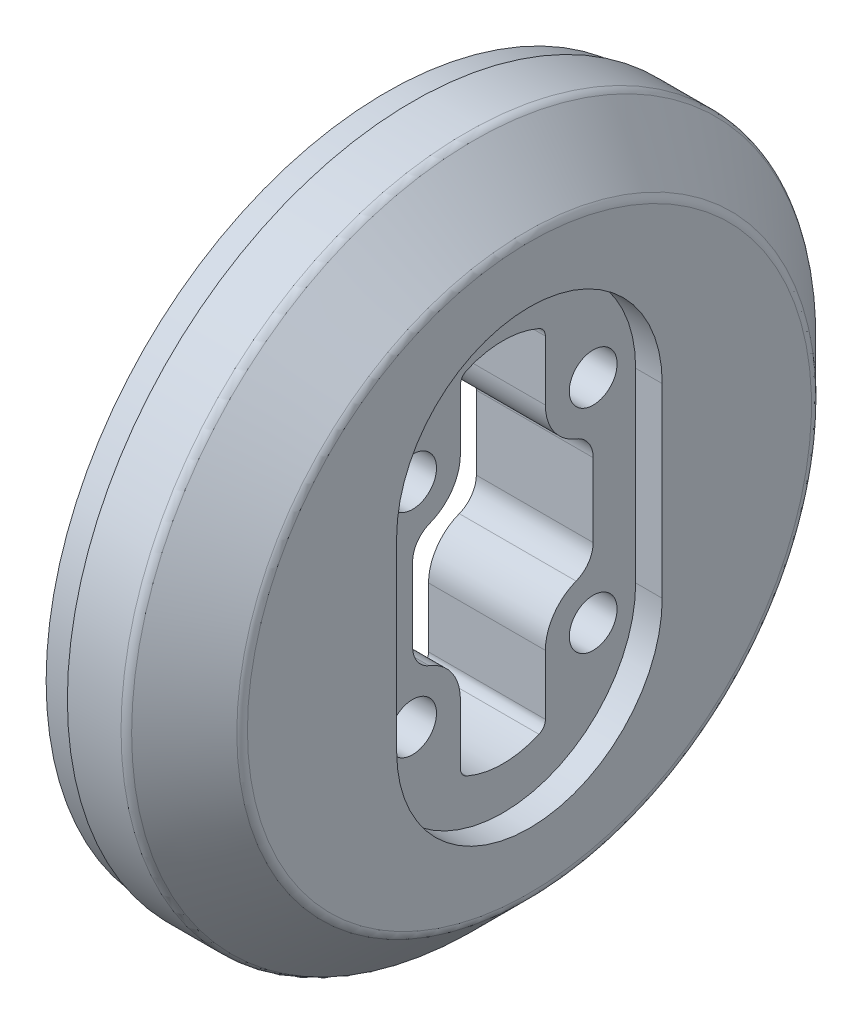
ISO-10303-21;
HEADER;
FILE_DESCRIPTION(('STEP AP214'),'2;1');
FILE_NAME('part.step','',(''),(''),'','','');
FILE_SCHEMA(('AUTOMOTIVE_DESIGN { 1 0 10303 214 1 1 1 1 }'));
ENDSEC;
DATA;
#1=APPLICATION_CONTEXT('core data for automotive mechanical design processes');
#2=APPLICATION_PROTOCOL_DEFINITION('international standard','automotive_design',2000,#1);
#3=PRODUCT_CONTEXT('',#1,'mechanical');
#4=PRODUCT('Part','Part','',(#3));
#5=PRODUCT_RELATED_PRODUCT_CATEGORY('part','',(#4));
#6=PRODUCT_DEFINITION_FORMATION('','',#4);
#7=PRODUCT_DEFINITION_CONTEXT('part definition',#1,'design');
#8=PRODUCT_DEFINITION('design','',#6,#7);
#9=PRODUCT_DEFINITION_SHAPE('','',#8);
#10=(LENGTH_UNIT() NAMED_UNIT(*) SI_UNIT(.MILLI.,.METRE.));
#11=(NAMED_UNIT(*) PLANE_ANGLE_UNIT() SI_UNIT($,.RADIAN.));
#12=(NAMED_UNIT(*) SI_UNIT($,.STERADIAN.) SOLID_ANGLE_UNIT());
#13=UNCERTAINTY_MEASURE_WITH_UNIT(LENGTH_MEASURE(1.E-05),#10,'distance_accuracy_value','');
#14=(GEOMETRIC_REPRESENTATION_CONTEXT(3) GLOBAL_UNCERTAINTY_ASSIGNED_CONTEXT((#13)) GLOBAL_UNIT_ASSIGNED_CONTEXT((#10,
#11,#12)) REPRESENTATION_CONTEXT('',''));
#15=CARTESIAN_POINT('',(0.,0.,0.));
#16=DIRECTION('',(0.,0.,1.));
#17=DIRECTION('',(1.,0.,0.));
#18=AXIS2_PLACEMENT_3D('',#15,#16,#17);
#19=CARTESIAN_POINT('',(0.,0.,0.));
#20=DIRECTION('',(1.,0.,0.));
#21=DIRECTION('',(0.,0.,-1.));
#22=AXIS2_PLACEMENT_3D('',#19,#20,#21);
#23=PLANE('',#22);
#24=CARTESIAN_POINT('',(0.,-17.5001431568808,-2.33473213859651E-13));
#25=DIRECTION('',(1.,0.,0.));
#26=DIRECTION('',(0.,0.,-1.));
#27=AXIS2_PLACEMENT_3D('',#24,#25,#26);
#28=CIRCLE('',#27,16.9999999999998);
#29=CARTESIAN_POINT('',(0.,-33.0809005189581,6.80000000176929));
#30=VERTEX_POINT('',#29);
#31=CARTESIAN_POINT('',(0.,-33.0809005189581,-6.80000000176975));
#32=VERTEX_POINT('',#31);
#33=EDGE_CURVE('E201',#30,#32,#28,.T.);
#34=ORIENTED_EDGE('',*,*,#33,.T.);
#35=CARTESIAN_POINT('',(0.,-31.2478702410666,-6.00000000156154));
#36=DIRECTION('',(1.,0.,0.));
#37=DIRECTION('',(0.,0.,-1.));
#38=AXIS2_PLACEMENT_3D('',#35,#36,#37);
#39=CIRCLE('',#38,2.00000000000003);
#40=CARTESIAN_POINT('',(0.,-31.2478702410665,-8.00000000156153));
#41=VERTEX_POINT('',#40);
#42=EDGE_CURVE('E195',#32,#41,#39,.T.);
#43=ORIENTED_EDGE('',*,*,#42,.T.);
#44=DIRECTION('',(0.,1.,0.));
#45=VECTOR('',#44,1.);
#46=CARTESIAN_POINT('',(0.,-31.2478702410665,-8.00000000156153));
#47=LINE('',#46,#45);
#48=CARTESIAN_POINT('',(0.,-20.0000000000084,-8.00000000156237));
#49=VERTEX_POINT('',#48);
#50=EDGE_CURVE('E204',#41,#49,#47,.T.);
#51=ORIENTED_EDGE('',*,*,#50,.T.);
#52=CARTESIAN_POINT('',(0.,-19.9999955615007,-17.0000000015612));
#53=DIRECTION('',(-1.,0.,0.));
#54=DIRECTION('',(0.,0.,-1.));
#55=AXIS2_PLACEMENT_3D('',#52,#53,#54);
#56=CIRCLE('',#55,8.99999999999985);
#57=CARTESIAN_POINT('',(0.,-11.5935475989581,-13.7857142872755));
#58=VERTEX_POINT('',#57);
#59=EDGE_CURVE('E47',#49,#58,#56,.T.);
#60=ORIENTED_EDGE('',*,*,#59,.T.);
#61=CARTESIAN_POINT('',(0.,-6.92329873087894,-12.0000000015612));
#62=DIRECTION('',(1.,0.,0.));
#63=DIRECTION('',(0.,0.,-1.));
#64=AXIS2_PLACEMENT_3D('',#61,#62,#63);
#65=CIRCLE('',#64,5.);
#66=CARTESIAN_POINT('',(0.,-6.92329873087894,-17.0000000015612));
#67=VERTEX_POINT('',#66);
#68=EDGE_CURVE('E218',#58,#67,#65,.T.);
#69=ORIENTED_EDGE('',*,*,#68,.T.);
#70=DIRECTION('',(0.,1.,0.));
#71=VECTOR('',#70,1.);
#72=CARTESIAN_POINT('',(0.,-6.92329873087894,-17.0000000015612));
#73=LINE('',#72,#71);
#74=CARTESIAN_POINT('',(0.,6.92329873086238,-17.0000000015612));
#75=VERTEX_POINT('',#74);
#76=EDGE_CURVE('E221',#67,#75,#73,.T.);
#77=ORIENTED_EDGE('',*,*,#76,.T.);
#78=CARTESIAN_POINT('',(0.,6.92329873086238,-12.0000000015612));
#79=DIRECTION('',(1.,0.,0.));
#80=DIRECTION('',(0.,0.,-1.));
#81=AXIS2_PLACEMENT_3D('',#78,#79,#80);
#82=CIRCLE('',#81,5.);
#83=CARTESIAN_POINT('',(0.,11.5935475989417,-13.7857142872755));
#84=VERTEX_POINT('',#83);
#85=EDGE_CURVE('E224',#75,#84,#82,.T.);
#86=ORIENTED_EDGE('',*,*,#85,.T.);
#87=CARTESIAN_POINT('',(0.,19.9999955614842,-17.0000000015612));
#88=DIRECTION('',(-1.,0.,0.));
#89=DIRECTION('',(0.,0.,-1.));
#90=AXIS2_PLACEMENT_3D('',#87,#88,#89);
#91=CIRCLE('',#90,8.99999999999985);
#92=CARTESIAN_POINT('',(0.,19.9999999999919,-8.00000000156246));
#93=VERTEX_POINT('',#92);
#94=EDGE_CURVE('E227',#84,#93,#91,.T.);
#95=ORIENTED_EDGE('',*,*,#94,.T.);
#96=DIRECTION('',(0.,1.,1.1736961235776E-13));
#97=VECTOR('',#96,1.);
#98=CARTESIAN_POINT('',(0.,19.9999999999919,-8.00000000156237));
#99=LINE('',#98,#97);
#100=CARTESIAN_POINT('',(0.,31.2475839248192,-8.00000000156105));
#101=VERTEX_POINT('',#100);
#102=EDGE_CURVE('E230',#93,#101,#99,.T.);
#103=ORIENTED_EDGE('',*,*,#102,.T.);
#104=CARTESIAN_POINT('',(0.,31.2475839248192,-6.0000000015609));
#105=DIRECTION('',(1.,0.,0.));
#106=DIRECTION('',(0.,0.,-1.));
#107=AXIS2_PLACEMENT_3D('',#104,#105,#106);
#108=CIRCLE('',#107,2.00000000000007);
#109=CARTESIAN_POINT('',(0.,33.0806142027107,-6.8000000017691));
#110=VERTEX_POINT('',#109);
#111=EDGE_CURVE('E233',#101,#110,#108,.T.);
#112=ORIENTED_EDGE('',*,*,#111,.T.);
#113=CARTESIAN_POINT('',(0.,17.4998568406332,-1.47702501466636E-13));
#114=DIRECTION('',(1.,0.,0.));
#115=DIRECTION('',(0.,0.,-1.));
#116=AXIS2_PLACEMENT_3D('',#113,#114,#115);
#117=CIRCLE('',#116,16.9999999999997);
#118=CARTESIAN_POINT('',(0.,33.0806142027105,6.80000000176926));
#119=VERTEX_POINT('',#118);
#120=EDGE_CURVE('E236',#110,#119,#117,.T.);
#121=ORIENTED_EDGE('',*,*,#120,.T.);
#122=CARTESIAN_POINT('',(0.,31.2475839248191,6.0000000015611));
#123=DIRECTION('',(1.,0.,0.));
#124=DIRECTION('',(0.,0.,-1.));
#125=AXIS2_PLACEMENT_3D('',#122,#123,#124);
#126=CIRCLE('',#125,2.00000000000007);
#127=CARTESIAN_POINT('',(0.,31.2475839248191,8.00000000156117));
#128=VERTEX_POINT('',#127);
#129=EDGE_CURVE('E239',#119,#128,#126,.T.);
#130=ORIENTED_EDGE('',*,*,#129,.T.);
#131=DIRECTION('',(0.,-1.,1.17986535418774E-13));
#132=VECTOR('',#131,1.);
#133=CARTESIAN_POINT('',(0.,31.2475839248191,8.00000000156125));
#134=LINE('',#133,#132);
#135=CARTESIAN_POINT('',(0.,19.9999999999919,8.00000000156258));
#136=VERTEX_POINT('',#135);
#137=EDGE_CURVE('E242',#128,#136,#134,.T.);
#138=ORIENTED_EDGE('',*,*,#137,.T.);
#139=CARTESIAN_POINT('',(0.,19.9999999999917,17.0000000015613));
#140=DIRECTION('',(-1.,0.,0.));
#141=DIRECTION('',(0.,0.,-1.));
#142=AXIS2_PLACEMENT_3D('',#139,#140,#141);
#143=CIRCLE('',#142,8.99999999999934);
#144=CARTESIAN_POINT('',(0.,11.5581126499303,13.8799778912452));
#145=VERTEX_POINT('',#144);
#146=EDGE_CURVE('E245',#136,#145,#143,.T.);
#147=ORIENTED_EDGE('',*,*,#146,.T.);
#148=CARTESIAN_POINT('',(0.,6.92499999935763,12.0000132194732));
#149=DIRECTION('',(1.,0.,0.));
#150=DIRECTION('',(0.,0.,-1.));
#151=AXIS2_PLACEMENT_3D('',#148,#149,#150);
#152=CIRCLE('',#151,4.99999999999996);
#153=CARTESIAN_POINT('',(0.,6.936496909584,17.0000000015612));
#154=VERTEX_POINT('',#153);
#155=EDGE_CURVE('E248',#145,#154,#152,.T.);
#156=ORIENTED_EDGE('',*,*,#155,.T.);
#157=DIRECTION('',(0.,-1.,0.));
#158=VECTOR('',#157,1.);
#159=CARTESIAN_POINT('',(0.,6.936496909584,17.0000000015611));
#160=LINE('',#159,#158);
#161=CARTESIAN_POINT('',(0.,-6.93649690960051,17.0000000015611));
#162=VERTEX_POINT('',#161);
#163=EDGE_CURVE('E251',#154,#162,#160,.T.);
#164=ORIENTED_EDGE('',*,*,#163,.T.);
#165=CARTESIAN_POINT('',(0.,-6.92499999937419,12.0000132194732));
#166=DIRECTION('',(1.,0.,0.));
#167=DIRECTION('',(0.,0.,-1.));
#168=AXIS2_PLACEMENT_3D('',#165,#166,#167);
#169=CIRCLE('',#168,4.99999999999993);
#170=CARTESIAN_POINT('',(0.,-11.5581126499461,13.8799778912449));
#171=VERTEX_POINT('',#170);
#172=EDGE_CURVE('E254',#162,#171,#169,.T.);
#173=ORIENTED_EDGE('',*,*,#172,.T.);
#174=CARTESIAN_POINT('',(0.,-20.0000000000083,17.0000000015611));
#175=DIRECTION('',(-1.,0.,0.));
#176=DIRECTION('',(0.,0.,-1.));
#177=AXIS2_PLACEMENT_3D('',#174,#175,#176);
#178=CIRCLE('',#177,9.00000000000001);
#179=CARTESIAN_POINT('',(0.,-20.0000000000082,8.00000000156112));
#180=VERTEX_POINT('',#179);
#181=EDGE_CURVE('E257',#171,#180,#178,.T.);
#182=ORIENTED_EDGE('',*,*,#181,.T.);
#183=DIRECTION('',(0.,-1.,0.));
#184=VECTOR('',#183,1.);
#185=CARTESIAN_POINT('',(0.,-20.0000000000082,8.0000000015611));
#186=LINE('',#185,#184);
#187=CARTESIAN_POINT('',(0.,-31.2478702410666,8.0000000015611));
#188=VERTEX_POINT('',#187);
#189=EDGE_CURVE('E260',#180,#188,#186,.T.);
#190=ORIENTED_EDGE('',*,*,#189,.T.);
#191=CARTESIAN_POINT('',(0.,-31.2478702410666,6.0000000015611));
#192=DIRECTION('',(1.,0.,0.));
#193=DIRECTION('',(0.,0.,-1.));
#194=AXIS2_PLACEMENT_3D('',#191,#192,#193);
#195=CIRCLE('',#194,2.);
#196=EDGE_CURVE('E263',#188,#30,#195,.T.);
#197=ORIENTED_EDGE('',*,*,#196,.T.);
#198=EDGE_LOOP('',(#34,#43,#51,#60,#69,#77,#86,#95,#103,#112,#121,#130,#138,#147,#156,#164,#173,
#182,#190,#197));
#199=FACE_BOUND('',#198,.T.);
#200=CARTESIAN_POINT('',(0.,-20.,-17.0000000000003));
#201=DIRECTION('',(1.,0.,0.));
#202=DIRECTION('',(0.,0.,-1.));
#203=AXIS2_PLACEMENT_3D('',#200,#201,#202);
#204=CIRCLE('',#203,4.49999999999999);
#205=CARTESIAN_POINT('',(0.,-20.,-21.5000000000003));
#206=VERTEX_POINT('',#205);
#207=EDGE_CURVE('E321',#206,#206,#204,.T.);
#208=ORIENTED_EDGE('',*,*,#207,.T.);
#209=EDGE_LOOP('',(#208));
#210=FACE_BOUND('',#209,.T.);
#211=CARTESIAN_POINT('',(0.,-20.0000000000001,16.9999999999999));
#212=DIRECTION('',(1.,0.,0.));
#213=DIRECTION('',(0.,0.,-1.));
#214=AXIS2_PLACEMENT_3D('',#211,#212,#213);
#215=CIRCLE('',#214,4.49999999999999);
#216=CARTESIAN_POINT('',(0.,-20.0000000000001,12.4999999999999));
#217=VERTEX_POINT('',#216);
#218=EDGE_CURVE('E362',#217,#217,#215,.T.);
#219=ORIENTED_EDGE('',*,*,#218,.T.);
#220=EDGE_LOOP('',(#219));
#221=FACE_BOUND('',#220,.T.);
#222=CARTESIAN_POINT('',(0.,19.9999999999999,17.));
#223=DIRECTION('',(1.,0.,0.));
#224=DIRECTION('',(0.,0.,-1.));
#225=AXIS2_PLACEMENT_3D('',#222,#223,#224);
#226=CIRCLE('',#225,4.5);
#227=CARTESIAN_POINT('',(0.,19.9999999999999,12.5000000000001));
#228=VERTEX_POINT('',#227);
#229=EDGE_CURVE('E368',#228,#228,#226,.T.);
#230=ORIENTED_EDGE('',*,*,#229,.T.);
#231=EDGE_LOOP('',(#230));
#232=FACE_BOUND('',#231,.T.);
#233=CARTESIAN_POINT('',(0.,20.,-17.0000000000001));
#234=DIRECTION('',(1.,0.,0.));
#235=DIRECTION('',(0.,0.,-1.));
#236=AXIS2_PLACEMENT_3D('',#233,#234,#235);
#237=CIRCLE('',#236,4.49999999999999);
#238=CARTESIAN_POINT('',(0.,20.,-21.5000000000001));
#239=VERTEX_POINT('',#238);
#240=EDGE_CURVE('E374',#239,#239,#237,.T.);
#241=ORIENTED_EDGE('',*,*,#240,.T.);
#242=EDGE_LOOP('',(#241));
#243=FACE_BOUND('',#242,.T.);
#244=CARTESIAN_POINT('',(0.,0.,0.));
#245=DIRECTION('',(-1.,0.,0.));
#246=DIRECTION('',(0.,0.,1.));
#247=AXIS2_PLACEMENT_3D('',#244,#245,#246);
#248=CIRCLE('',#247,64.);
#249=CARTESIAN_POINT('',(0.,0.,64.));
#250=VERTEX_POINT('',#249);
#251=EDGE_CURVE('E11',#250,#250,#248,.T.);
#252=ORIENTED_EDGE('',*,*,#251,.T.);
#253=EDGE_LOOP('',(#252));
#254=FACE_BOUND('',#253,.T.);
#255=ADVANCED_FACE('F33',(#199,#210,#221,#232,#243,#254),#23,.F.);
#256=CARTESIAN_POINT('',(-23.9525272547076,0.,0.));
#257=DIRECTION('',(-1.,0.,0.));
#258=DIRECTION('',(0.,0.,1.));
#259=AXIS2_PLACEMENT_3D('',#256,#257,#258);
#260=CYLINDRICAL_SURFACE('',#259,64.);
#261=ORIENTED_EDGE('',*,*,#251,.F.);
#262=EDGE_LOOP('',(#261));
#263=FACE_BOUND('',#262,.T.);
#264=CARTESIAN_POINT('',(5.,0.,0.));
#265=DIRECTION('',(-1.,0.,0.));
#266=DIRECTION('',(0.,0.,1.));
#267=AXIS2_PLACEMENT_3D('',#264,#265,#266);
#268=CIRCLE('',#267,64.);
#269=CARTESIAN_POINT('',(5.,0.,64.));
#270=VERTEX_POINT('',#269);
#271=EDGE_CURVE('E40',#270,#270,#268,.T.);
#272=ORIENTED_EDGE('',*,*,#271,.T.);
#273=EDGE_LOOP('',(#272));
#274=FACE_BOUND('',#273,.T.);
#275=ADVANCED_FACE('F429',(#263,#274),#260,.T.);
#276=CARTESIAN_POINT('',(5.,64.,0.));
#277=DIRECTION('',(1.,0.,0.));
#278=DIRECTION('',(0.,0.,-1.));
#279=AXIS2_PLACEMENT_3D('',#276,#277,#278);
#280=PLANE('',#279);
#281=ORIENTED_EDGE('',*,*,#271,.F.);
#282=EDGE_LOOP('',(#281));
#283=FACE_BOUND('',#282,.T.);
#284=CARTESIAN_POINT('',(5.,0.,0.));
#285=DIRECTION('',(-1.,0.,0.));
#286=DIRECTION('',(0.,0.,1.));
#287=AXIS2_PLACEMENT_3D('',#284,#285,#286);
#288=CIRCLE('',#287,65.);
#289=CARTESIAN_POINT('',(5.,0.,65.));
#290=VERTEX_POINT('',#289);
#291=EDGE_CURVE('E424',#290,#290,#288,.T.);
#292=ORIENTED_EDGE('',*,*,#291,.T.);
#293=EDGE_LOOP('',(#292));
#294=FACE_BOUND('',#293,.T.);
#295=ADVANCED_FACE('F431',(#283,#294),#280,.F.);
#296=CARTESIAN_POINT('',(-23.9525272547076,0.,0.));
#297=DIRECTION('',(-1.,0.,0.));
#298=DIRECTION('',(0.,0.,1.));
#299=AXIS2_PLACEMENT_3D('',#296,#297,#298);
#300=CYLINDRICAL_SURFACE('',#299,65.);
#301=ORIENTED_EDGE('',*,*,#291,.F.);
#302=EDGE_LOOP('',(#301));
#303=FACE_BOUND('',#302,.T.);
#304=CARTESIAN_POINT('',(15.1,0.,0.));
#305=DIRECTION('',(-1.,0.,0.));
#306=DIRECTION('',(0.,0.,1.));
#307=AXIS2_PLACEMENT_3D('',#304,#305,#306);
#308=CIRCLE('',#307,65.);
#309=CARTESIAN_POINT('',(15.1,0.,65.));
#310=VERTEX_POINT('',#309);
#311=EDGE_CURVE('E421',#310,#310,#308,.T.);
#312=ORIENTED_EDGE('',*,*,#311,.T.);
#313=EDGE_LOOP('',(#312));
#314=FACE_BOUND('',#313,.T.);
#315=ADVANCED_FACE('F434',(#303,#314),#300,.T.);
#316=CARTESIAN_POINT('',(15.1,0.,0.));
#317=DIRECTION('',(-1.,0.,0.));
#318=DIRECTION('',(0.,0.,1.));
#319=AXIS2_PLACEMENT_3D('',#316,#317,#318);
#320=TOROIDAL_SURFACE('',#319,63.,2.);
#321=ORIENTED_EDGE('',*,*,#311,.F.);
#322=EDGE_LOOP('',(#321));
#323=FACE_BOUND('',#322,.T.);
#324=CARTESIAN_POINT('',(16.5142135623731,0.,0.));
#325=DIRECTION('',(-1.,0.,0.));
#326=DIRECTION('',(0.,0.,1.));
#327=AXIS2_PLACEMENT_3D('',#324,#325,#326);
#328=CIRCLE('',#327,64.4142135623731);
#329=CARTESIAN_POINT('',(16.5142135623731,0.,64.4142135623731));
#330=VERTEX_POINT('',#329);
#331=EDGE_CURVE('E418',#330,#330,#328,.T.);
#332=ORIENTED_EDGE('',*,*,#331,.T.);
#333=EDGE_LOOP('',(#332));
#334=FACE_BOUND('',#333,.T.);
#335=ADVANCED_FACE('F440',(#323,#334),#320,.T.);
#336=CARTESIAN_POINT('',(26.4142135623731,0.,0.));
#337=DIRECTION('',(-1.,0.,0.));
#338=DIRECTION('',(0.,0.,1.));
#339=AXIS2_PLACEMENT_3D('',#336,#337,#338);
#340=CONICAL_SURFACE('',#339,54.5142135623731,0.78539816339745);
#341=ORIENTED_EDGE('',*,*,#331,.F.);
#342=EDGE_LOOP('',(#341));
#343=FACE_BOUND('',#342,.T.);
#344=CARTESIAN_POINT('',(26.4142135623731,0.,0.));
#345=DIRECTION('',(-1.,0.,0.));
#346=DIRECTION('',(0.,0.,1.));
#347=AXIS2_PLACEMENT_3D('',#344,#345,#346);
#348=CIRCLE('',#347,54.5142135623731);
#349=CARTESIAN_POINT('',(26.4142135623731,0.,54.5142135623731));
#350=VERTEX_POINT('',#349);
#351=EDGE_CURVE('E415',#350,#350,#348,.T.);
#352=ORIENTED_EDGE('',*,*,#351,.T.);
#353=EDGE_LOOP('',(#352));
#354=FACE_BOUND('',#353,.T.);
#355=ADVANCED_FACE('F446',(#343,#354),#340,.T.);
#356=CARTESIAN_POINT('',(25.,0.,0.));
#357=DIRECTION('',(-1.,0.,0.));
#358=DIRECTION('',(0.,0.,1.));
#359=AXIS2_PLACEMENT_3D('',#356,#357,#358);
#360=TOROIDAL_SURFACE('',#359,53.1,2.);
#361=ORIENTED_EDGE('',*,*,#351,.F.);
#362=EDGE_LOOP('',(#361));
#363=FACE_BOUND('',#362,.T.);
#364=CARTESIAN_POINT('',(27.,0.,0.));
#365=DIRECTION('',(-1.,0.,0.));
#366=DIRECTION('',(0.,0.,1.));
#367=AXIS2_PLACEMENT_3D('',#364,#365,#366);
#368=CIRCLE('',#367,53.1);
#369=CARTESIAN_POINT('',(27.,0.,53.1));
#370=VERTEX_POINT('',#369);
#371=EDGE_CURVE('E406',#370,#370,#368,.T.);
#372=ORIENTED_EDGE('',*,*,#371,.T.);
#373=EDGE_LOOP('',(#372));
#374=FACE_BOUND('',#373,.T.);
#375=ADVANCED_FACE('F452',(#363,#374),#360,.T.);
#376=CARTESIAN_POINT('',(27.,53.1,0.));
#377=DIRECTION('',(-1.,0.,0.));
#378=DIRECTION('',(0.,0.,1.));
#379=AXIS2_PLACEMENT_3D('',#376,#377,#378);
#380=PLANE('',#379);
#381=DIRECTION('',(0.,1.,0.));
#382=VECTOR('',#381,1.);
#383=CARTESIAN_POINT('',(27.,-17.5,-24.9999999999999));
#384=LINE('',#383,#382);
#385=CARTESIAN_POINT('',(27.,-17.5,-24.9999999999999));
#386=VERTEX_POINT('',#385);
#387=CARTESIAN_POINT('',(27.,17.5000000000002,-24.9999999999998));
#388=VERTEX_POINT('',#387);
#389=EDGE_CURVE('E396',#386,#388,#384,.T.);
#390=ORIENTED_EDGE('',*,*,#389,.F.);
#391=CARTESIAN_POINT('',(27.,-17.5000000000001,0.));
#392=DIRECTION('',(1.,0.,0.));
#393=DIRECTION('',(0.,0.,-1.));
#394=AXIS2_PLACEMENT_3D('',#391,#392,#393);
#395=CIRCLE('',#394,25.);
#396=CARTESIAN_POINT('',(27.,-17.5000000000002,25.0000000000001));
#397=VERTEX_POINT('',#396);
#398=EDGE_CURVE('E380',#397,#386,#395,.T.);
#399=ORIENTED_EDGE('',*,*,#398,.F.);
#400=DIRECTION('',(0.,-1.,0.));
#401=VECTOR('',#400,1.);
#402=CARTESIAN_POINT('',(27.,17.5,25.0000000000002));
#403=LINE('',#402,#401);
#404=CARTESIAN_POINT('',(27.,17.5,25.0000000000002));
#405=VERTEX_POINT('',#404);
#406=EDGE_CURVE('E385',#405,#397,#403,.T.);
#407=ORIENTED_EDGE('',*,*,#406,.F.);
#408=CARTESIAN_POINT('',(27.,17.5000000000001,2.22044604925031E-13));
#409=DIRECTION('',(1.,0.,0.));
#410=DIRECTION('',(0.,0.,-1.));
#411=AXIS2_PLACEMENT_3D('',#408,#409,#410);
#412=CIRCLE('',#411,25.);
#413=EDGE_CURVE('E399',#388,#405,#412,.T.);
#414=ORIENTED_EDGE('',*,*,#413,.F.);
#415=EDGE_LOOP('',(#390,#399,#407,#414));
#416=FACE_BOUND('',#415,.T.);
#417=ORIENTED_EDGE('',*,*,#371,.F.);
#418=EDGE_LOOP('',(#417));
#419=FACE_BOUND('',#418,.T.);
#420=ADVANCED_FACE('F458',(#416,#419),#380,.F.);
#421=CARTESIAN_POINT('',(22.,-17.5000000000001,0.));
#422=DIRECTION('',(1.,0.,0.));
#423=DIRECTION('',(0.,0.,-1.));
#424=AXIS2_PLACEMENT_3D('',#421,#422,#423);
#425=CYLINDRICAL_SURFACE('',#424,25.);
#426=ORIENTED_EDGE('',*,*,#398,.T.);
#427=DIRECTION('',(1.,0.,0.));
#428=VECTOR('',#427,1.);
#429=CARTESIAN_POINT('',(22.,-17.5,-24.9999999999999));
#430=LINE('',#429,#428);
#431=CARTESIAN_POINT('',(22.,-17.5,-24.9999999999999));
#432=VERTEX_POINT('',#431);
#433=EDGE_CURVE('E394',#432,#386,#430,.T.);
#434=ORIENTED_EDGE('',*,*,#433,.F.);
#435=CARTESIAN_POINT('',(22.,-17.5000000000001,0.));
#436=DIRECTION('',(1.,0.,0.));
#437=DIRECTION('',(0.,0.,-1.));
#438=AXIS2_PLACEMENT_3D('',#435,#436,#437);
#439=CIRCLE('',#438,25.);
#440=CARTESIAN_POINT('',(22.,-17.5000000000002,25.0000000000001));
#441=VERTEX_POINT('',#440);
#442=EDGE_CURVE('E381',#441,#432,#439,.T.);
#443=ORIENTED_EDGE('',*,*,#442,.F.);
#444=DIRECTION('',(1.,0.,0.));
#445=VECTOR('',#444,1.);
#446=CARTESIAN_POINT('',(22.,-17.5000000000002,25.0000000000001));
#447=LINE('',#446,#445);
#448=EDGE_CURVE('E404',#441,#397,#447,.T.);
#449=ORIENTED_EDGE('',*,*,#448,.T.);
#450=EDGE_LOOP('',(#426,#434,#443,#449));
#451=FACE_BOUND('',#450,.T.);
#452=ADVANCED_FACE('F463',(#451),#425,.F.);
#453=CARTESIAN_POINT('',(22.,17.5,25.0000000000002));
#454=DIRECTION('',(0.,0.,1.));
#455=DIRECTION('',(0.,-1.,0.));
#456=AXIS2_PLACEMENT_3D('',#453,#454,#455);
#457=PLANE('',#456);
#458=ORIENTED_EDGE('',*,*,#406,.T.);
#459=ORIENTED_EDGE('',*,*,#448,.F.);
#460=DIRECTION('',(0.,-1.,0.));
#461=VECTOR('',#460,1.);
#462=CARTESIAN_POINT('',(22.,17.5,25.0000000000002));
#463=LINE('',#462,#461);
#464=CARTESIAN_POINT('',(22.,17.5,25.0000000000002));
#465=VERTEX_POINT('',#464);
#466=EDGE_CURVE('E391',#465,#441,#463,.T.);
#467=ORIENTED_EDGE('',*,*,#466,.F.);
#468=DIRECTION('',(1.,0.,0.));
#469=VECTOR('',#468,1.);
#470=CARTESIAN_POINT('',(22.,17.5,25.0000000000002));
#471=LINE('',#470,#469);
#472=EDGE_CURVE('E407',#465,#405,#471,.T.);
#473=ORIENTED_EDGE('',*,*,#472,.T.);
#474=EDGE_LOOP('',(#458,#459,#467,#473));
#475=FACE_BOUND('',#474,.T.);
#476=ADVANCED_FACE('F469',(#475),#457,.F.);
#477=CARTESIAN_POINT('',(22.,17.5000000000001,2.22044604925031E-13));
#478=DIRECTION('',(1.,0.,0.));
#479=DIRECTION('',(0.,0.,-1.));
#480=AXIS2_PLACEMENT_3D('',#477,#478,#479);
#481=CYLINDRICAL_SURFACE('',#480,25.);
#482=ORIENTED_EDGE('',*,*,#413,.T.);
#483=ORIENTED_EDGE('',*,*,#472,.F.);
#484=CARTESIAN_POINT('',(22.,17.5000000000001,2.22044604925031E-13));
#485=DIRECTION('',(1.,0.,0.));
#486=DIRECTION('',(0.,0.,-1.));
#487=AXIS2_PLACEMENT_3D('',#484,#485,#486);
#488=CIRCLE('',#487,25.);
#489=CARTESIAN_POINT('',(22.,17.5000000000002,-24.9999999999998));
#490=VERTEX_POINT('',#489);
#491=EDGE_CURVE('E388',#490,#465,#488,.T.);
#492=ORIENTED_EDGE('',*,*,#491,.F.);
#493=DIRECTION('',(1.,0.,0.));
#494=VECTOR('',#493,1.);
#495=CARTESIAN_POINT('',(22.,17.5000000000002,-24.9999999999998));
#496=LINE('',#495,#494);
#497=EDGE_CURVE('E409',#490,#388,#496,.T.);
#498=ORIENTED_EDGE('',*,*,#497,.T.);
#499=EDGE_LOOP('',(#482,#483,#492,#498));
#500=FACE_BOUND('',#499,.T.);
#501=ADVANCED_FACE('F521',(#500),#481,.F.);
#502=CARTESIAN_POINT('',(22.,-17.5,-24.9999999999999));
#503=DIRECTION('',(0.,0.,-1.));
#504=DIRECTION('',(0.,1.,0.));
#505=AXIS2_PLACEMENT_3D('',#502,#503,#504);
#506=PLANE('',#505);
#507=ORIENTED_EDGE('',*,*,#389,.T.);
#508=ORIENTED_EDGE('',*,*,#497,.F.);
#509=DIRECTION('',(0.,1.,0.));
#510=VECTOR('',#509,1.);
#511=CARTESIAN_POINT('',(22.,-17.5,-24.9999999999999));
#512=LINE('',#511,#510);
#513=EDGE_CURVE('E384',#432,#490,#512,.T.);
#514=ORIENTED_EDGE('',*,*,#513,.F.);
#515=ORIENTED_EDGE('',*,*,#433,.T.);
#516=EDGE_LOOP('',(#507,#508,#514,#515));
#517=FACE_BOUND('',#516,.T.);
#518=ADVANCED_FACE('F531',(#517),#506,.F.);
#519=CARTESIAN_POINT('',(22.,-17.5000000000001,0.));
#520=DIRECTION('',(1.,0.,0.));
#521=DIRECTION('',(0.,0.,-1.));
#522=AXIS2_PLACEMENT_3D('',#519,#520,#521);
#523=PLANE('',#522);
#524=CARTESIAN_POINT('',(22.,-31.2478702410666,-6.00000000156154));
#525=DIRECTION('',(1.,0.,0.));
#526=DIRECTION('',(0.,0.,-1.));
#527=AXIS2_PLACEMENT_3D('',#524,#525,#526);
#528=CIRCLE('',#527,2.00000000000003);
#529=CARTESIAN_POINT('',(22.,-33.0809005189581,-6.80000000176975));
#530=VERTEX_POINT('',#529);
#531=CARTESIAN_POINT('',(22.,-31.2478702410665,-8.00000000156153));
#532=VERTEX_POINT('',#531);
#533=EDGE_CURVE('E55',#530,#532,#528,.T.);
#534=ORIENTED_EDGE('',*,*,#533,.F.);
#535=CARTESIAN_POINT('',(22.,-17.5001431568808,-2.33473213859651E-13));
#536=DIRECTION('',(1.,0.,0.));
#537=DIRECTION('',(0.,0.,-1.));
#538=AXIS2_PLACEMENT_3D('',#535,#536,#537);
#539=CIRCLE('',#538,16.9999999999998);
#540=CARTESIAN_POINT('',(22.,-33.0809005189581,6.80000000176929));
#541=VERTEX_POINT('',#540);
#542=EDGE_CURVE('E211',#541,#530,#539,.T.);
#543=ORIENTED_EDGE('',*,*,#542,.F.);
#544=CARTESIAN_POINT('',(22.,-31.2478702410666,6.0000000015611));
#545=DIRECTION('',(1.,0.,0.));
#546=DIRECTION('',(0.,0.,-1.));
#547=AXIS2_PLACEMENT_3D('',#544,#545,#546);
#548=CIRCLE('',#547,2.);
#549=CARTESIAN_POINT('',(22.,-31.2478702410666,8.0000000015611));
#550=VERTEX_POINT('',#549);
#551=EDGE_CURVE('E214',#550,#541,#548,.T.);
#552=ORIENTED_EDGE('',*,*,#551,.F.);
#553=DIRECTION('',(0.,-1.,0.));
#554=VECTOR('',#553,1.);
#555=CARTESIAN_POINT('',(22.,-20.0000000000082,8.0000000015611));
#556=LINE('',#555,#554);
#557=CARTESIAN_POINT('',(22.,-20.0000000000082,8.00000000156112));
#558=VERTEX_POINT('',#557);
#559=EDGE_CURVE('E314',#558,#550,#556,.T.);
#560=ORIENTED_EDGE('',*,*,#559,.F.);
#561=CARTESIAN_POINT('',(22.,-20.0000000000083,17.0000000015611));
#562=DIRECTION('',(-1.,0.,0.));
#563=DIRECTION('',(0.,0.,-1.));
#564=AXIS2_PLACEMENT_3D('',#561,#562,#563);
#565=CIRCLE('',#564,9.00000000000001);
#566=CARTESIAN_POINT('',(22.,-11.5581126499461,13.8799778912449));
#567=VERTEX_POINT('',#566);
#568=EDGE_CURVE('E311',#567,#558,#565,.T.);
#569=ORIENTED_EDGE('',*,*,#568,.F.);
#570=CARTESIAN_POINT('',(22.,-6.92499999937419,12.0000132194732));
#571=DIRECTION('',(1.,0.,0.));
#572=DIRECTION('',(0.,0.,-1.));
#573=AXIS2_PLACEMENT_3D('',#570,#571,#572);
#574=CIRCLE('',#573,4.99999999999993);
#575=CARTESIAN_POINT('',(22.,-6.93649690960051,17.0000000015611));
#576=VERTEX_POINT('',#575);
#577=EDGE_CURVE('E308',#576,#567,#574,.T.);
#578=ORIENTED_EDGE('',*,*,#577,.F.);
#579=DIRECTION('',(0.,-1.,0.));
#580=VECTOR('',#579,1.);
#581=CARTESIAN_POINT('',(22.,6.936496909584,17.0000000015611));
#582=LINE('',#581,#580);
#583=CARTESIAN_POINT('',(22.,6.936496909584,17.0000000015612));
#584=VERTEX_POINT('',#583);
#585=EDGE_CURVE('E305',#584,#576,#582,.T.);
#586=ORIENTED_EDGE('',*,*,#585,.F.);
#587=CARTESIAN_POINT('',(22.,6.92499999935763,12.0000132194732));
#588=DIRECTION('',(1.,0.,0.));
#589=DIRECTION('',(0.,0.,-1.));
#590=AXIS2_PLACEMENT_3D('',#587,#588,#589);
#591=CIRCLE('',#590,4.99999999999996);
#592=CARTESIAN_POINT('',(22.,11.5581126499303,13.8799778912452));
#593=VERTEX_POINT('',#592);
#594=EDGE_CURVE('E302',#593,#584,#591,.T.);
#595=ORIENTED_EDGE('',*,*,#594,.F.);
#596=CARTESIAN_POINT('',(22.,19.9999999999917,17.0000000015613));
#597=DIRECTION('',(-1.,0.,0.));
#598=DIRECTION('',(0.,0.,-1.));
#599=AXIS2_PLACEMENT_3D('',#596,#597,#598);
#600=CIRCLE('',#599,8.99999999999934);
#601=CARTESIAN_POINT('',(22.,19.9999999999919,8.00000000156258));
#602=VERTEX_POINT('',#601);
#603=EDGE_CURVE('E299',#602,#593,#600,.T.);
#604=ORIENTED_EDGE('',*,*,#603,.F.);
#605=DIRECTION('',(0.,-1.,1.17986535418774E-13));
#606=VECTOR('',#605,1.);
#607=CARTESIAN_POINT('',(22.,31.2475839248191,8.00000000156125));
#608=LINE('',#607,#606);
#609=CARTESIAN_POINT('',(22.,31.2475839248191,8.00000000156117));
#610=VERTEX_POINT('',#609);
#611=EDGE_CURVE('E296',#610,#602,#608,.T.);
#612=ORIENTED_EDGE('',*,*,#611,.F.);
#613=CARTESIAN_POINT('',(22.,31.2475839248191,6.0000000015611));
#614=DIRECTION('',(1.,0.,0.));
#615=DIRECTION('',(0.,0.,-1.));
#616=AXIS2_PLACEMENT_3D('',#613,#614,#615);
#617=CIRCLE('',#616,2.00000000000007);
#618=CARTESIAN_POINT('',(22.,33.0806142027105,6.80000000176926));
#619=VERTEX_POINT('',#618);
#620=EDGE_CURVE('E293',#619,#610,#617,.T.);
#621=ORIENTED_EDGE('',*,*,#620,.F.);
#622=CARTESIAN_POINT('',(22.,17.4998568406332,-1.47702501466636E-13));
#623=DIRECTION('',(1.,0.,0.));
#624=DIRECTION('',(0.,0.,-1.));
#625=AXIS2_PLACEMENT_3D('',#622,#623,#624);
#626=CIRCLE('',#625,16.9999999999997);
#627=CARTESIAN_POINT('',(22.,33.0806142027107,-6.8000000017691));
#628=VERTEX_POINT('',#627);
#629=EDGE_CURVE('E290',#628,#619,#626,.T.);
#630=ORIENTED_EDGE('',*,*,#629,.F.);
#631=CARTESIAN_POINT('',(22.,31.2475839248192,-6.0000000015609));
#632=DIRECTION('',(1.,0.,0.));
#633=DIRECTION('',(0.,0.,-1.));
#634=AXIS2_PLACEMENT_3D('',#631,#632,#633);
#635=CIRCLE('',#634,2.00000000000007);
#636=CARTESIAN_POINT('',(22.,31.2475839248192,-8.00000000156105));
#637=VERTEX_POINT('',#636);
#638=EDGE_CURVE('E287',#637,#628,#635,.T.);
#639=ORIENTED_EDGE('',*,*,#638,.F.);
#640=DIRECTION('',(0.,1.,1.1736961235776E-13));
#641=VECTOR('',#640,1.);
#642=CARTESIAN_POINT('',(22.,19.9999999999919,-8.00000000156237));
#643=LINE('',#642,#641);
#644=CARTESIAN_POINT('',(22.,19.9999999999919,-8.00000000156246));
#645=VERTEX_POINT('',#644);
#646=EDGE_CURVE('E284',#645,#637,#643,.T.);
#647=ORIENTED_EDGE('',*,*,#646,.F.);
#648=CARTESIAN_POINT('',(22.,19.9999955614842,-17.0000000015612));
#649=DIRECTION('',(-1.,0.,0.));
#650=DIRECTION('',(0.,0.,-1.));
#651=AXIS2_PLACEMENT_3D('',#648,#649,#650);
#652=CIRCLE('',#651,8.99999999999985);
#653=CARTESIAN_POINT('',(22.,11.5935475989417,-13.7857142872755));
#654=VERTEX_POINT('',#653);
#655=EDGE_CURVE('E281',#654,#645,#652,.T.);
#656=ORIENTED_EDGE('',*,*,#655,.F.);
#657=CARTESIAN_POINT('',(22.,6.92329873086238,-12.0000000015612));
#658=DIRECTION('',(1.,0.,0.));
#659=DIRECTION('',(0.,0.,-1.));
#660=AXIS2_PLACEMENT_3D('',#657,#658,#659);
#661=CIRCLE('',#660,5.);
#662=CARTESIAN_POINT('',(22.,6.92329873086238,-17.0000000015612));
#663=VERTEX_POINT('',#662);
#664=EDGE_CURVE('E278',#663,#654,#661,.T.);
#665=ORIENTED_EDGE('',*,*,#664,.F.);
#666=DIRECTION('',(0.,1.,0.));
#667=VECTOR('',#666,1.);
#668=CARTESIAN_POINT('',(22.,-6.92329873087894,-17.0000000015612));
#669=LINE('',#668,#667);
#670=CARTESIAN_POINT('',(22.,-6.92329873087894,-17.0000000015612));
#671=VERTEX_POINT('',#670);
#672=EDGE_CURVE('E275',#671,#663,#669,.T.);
#673=ORIENTED_EDGE('',*,*,#672,.F.);
#674=CARTESIAN_POINT('',(22.,-6.92329873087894,-12.0000000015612));
#675=DIRECTION('',(1.,0.,0.));
#676=DIRECTION('',(0.,0.,-1.));
#677=AXIS2_PLACEMENT_3D('',#674,#675,#676);
#678=CIRCLE('',#677,5.);
#679=CARTESIAN_POINT('',(22.,-11.5935475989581,-13.7857142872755));
#680=VERTEX_POINT('',#679);
#681=EDGE_CURVE('E272',#680,#671,#678,.T.);
#682=ORIENTED_EDGE('',*,*,#681,.F.);
#683=CARTESIAN_POINT('',(22.,-19.9999955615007,-17.0000000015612));
#684=DIRECTION('',(-1.,0.,0.));
#685=DIRECTION('',(0.,0.,-1.));
#686=AXIS2_PLACEMENT_3D('',#683,#684,#685);
#687=CIRCLE('',#686,8.99999999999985);
#688=CARTESIAN_POINT('',(22.,-20.0000000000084,-8.00000000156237));
#689=VERTEX_POINT('',#688);
#690=EDGE_CURVE('E269',#689,#680,#687,.T.);
#691=ORIENTED_EDGE('',*,*,#690,.F.);
#692=DIRECTION('',(0.,1.,0.));
#693=VECTOR('',#692,1.);
#694=CARTESIAN_POINT('',(22.,-31.2478702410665,-8.00000000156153));
#695=LINE('',#694,#693);
#696=EDGE_CURVE('E267',#532,#689,#695,.T.);
#697=ORIENTED_EDGE('',*,*,#696,.F.);
#698=EDGE_LOOP('',(#534,#543,#552,#560,#569,#578,#586,#595,#604,#612,#621,#630,#639,#647,#656,
#665,#673,#682,#691,#697));
#699=FACE_BOUND('',#698,.T.);
#700=CARTESIAN_POINT('',(22.,-20.,-17.0000000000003));
#701=DIRECTION('',(1.,0.,0.));
#702=DIRECTION('',(0.,0.,-1.));
#703=AXIS2_PLACEMENT_3D('',#700,#701,#702);
#704=CIRCLE('',#703,4.49999999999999);
#705=CARTESIAN_POINT('',(22.,-20.,-21.5000000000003));
#706=VERTEX_POINT('',#705);
#707=EDGE_CURVE('E359',#706,#706,#704,.T.);
#708=ORIENTED_EDGE('',*,*,#707,.F.);
#709=EDGE_LOOP('',(#708));
#710=FACE_BOUND('',#709,.T.);
#711=CARTESIAN_POINT('',(22.,-20.0000000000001,16.9999999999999));
#712=DIRECTION('',(1.,0.,0.));
#713=DIRECTION('',(0.,0.,-1.));
#714=AXIS2_PLACEMENT_3D('',#711,#712,#713);
#715=CIRCLE('',#714,4.49999999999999);
#716=CARTESIAN_POINT('',(22.,-20.0000000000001,12.4999999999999));
#717=VERTEX_POINT('',#716);
#718=EDGE_CURVE('E365',#717,#717,#715,.T.);
#719=ORIENTED_EDGE('',*,*,#718,.F.);
#720=EDGE_LOOP('',(#719));
#721=FACE_BOUND('',#720,.T.);
#722=CARTESIAN_POINT('',(22.,20.,-17.0000000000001));
#723=DIRECTION('',(1.,0.,0.));
#724=DIRECTION('',(0.,0.,-1.));
#725=AXIS2_PLACEMENT_3D('',#722,#723,#724);
#726=CIRCLE('',#725,4.49999999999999);
#727=CARTESIAN_POINT('',(22.,20.,-21.5000000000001));
#728=VERTEX_POINT('',#727);
#729=EDGE_CURVE('E377',#728,#728,#726,.T.);
#730=ORIENTED_EDGE('',*,*,#729,.F.);
#731=EDGE_LOOP('',(#730));
#732=FACE_BOUND('',#731,.T.);
#733=CARTESIAN_POINT('',(22.,19.9999999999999,17.));
#734=DIRECTION('',(1.,0.,0.));
#735=DIRECTION('',(0.,0.,-1.));
#736=AXIS2_PLACEMENT_3D('',#733,#734,#735);
#737=CIRCLE('',#736,4.5);
#738=CARTESIAN_POINT('',(22.,19.9999999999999,12.5000000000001));
#739=VERTEX_POINT('',#738);
#740=EDGE_CURVE('E371',#739,#739,#737,.T.);
#741=ORIENTED_EDGE('',*,*,#740,.F.);
#742=EDGE_LOOP('',(#741));
#743=FACE_BOUND('',#742,.T.);
#744=ORIENTED_EDGE('',*,*,#442,.T.);
#745=ORIENTED_EDGE('',*,*,#513,.T.);
#746=ORIENTED_EDGE('',*,*,#491,.T.);
#747=ORIENTED_EDGE('',*,*,#466,.T.);
#748=EDGE_LOOP('',(#744,#745,#746,#747));
#749=FACE_BOUND('',#748,.T.);
#750=ADVANCED_FACE('F541',(#699,#710,#721,#732,#743,#749),#523,.T.);
#751=CARTESIAN_POINT('',(0.,20.,-17.0000000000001));
#752=DIRECTION('',(1.,0.,0.));
#753=DIRECTION('',(0.,0.,-1.));
#754=AXIS2_PLACEMENT_3D('',#751,#752,#753);
#755=CYLINDRICAL_SURFACE('',#754,4.49999999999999);
#756=ORIENTED_EDGE('',*,*,#729,.T.);
#757=EDGE_LOOP('',(#756));
#758=FACE_BOUND('',#757,.T.);
#759=ORIENTED_EDGE('',*,*,#240,.F.);
#760=EDGE_LOOP('',(#759));
#761=FACE_BOUND('',#760,.T.);
#762=ADVANCED_FACE('F549',(#758,#761),#755,.F.);
#763=CARTESIAN_POINT('',(0.,19.9999999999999,17.));
#764=DIRECTION('',(1.,0.,0.));
#765=DIRECTION('',(0.,0.,-1.));
#766=AXIS2_PLACEMENT_3D('',#763,#764,#765);
#767=CYLINDRICAL_SURFACE('',#766,4.5);
#768=ORIENTED_EDGE('',*,*,#740,.T.);
#769=EDGE_LOOP('',(#768));
#770=FACE_BOUND('',#769,.T.);
#771=ORIENTED_EDGE('',*,*,#229,.F.);
#772=EDGE_LOOP('',(#771));
#773=FACE_BOUND('',#772,.T.);
#774=ADVANCED_FACE('F554',(#770,#773),#767,.F.);
#775=CARTESIAN_POINT('',(0.,-20.0000000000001,16.9999999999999));
#776=DIRECTION('',(1.,0.,0.));
#777=DIRECTION('',(0.,0.,-1.));
#778=AXIS2_PLACEMENT_3D('',#775,#776,#777);
#779=CYLINDRICAL_SURFACE('',#778,4.49999999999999);
#780=ORIENTED_EDGE('',*,*,#718,.T.);
#781=EDGE_LOOP('',(#780));
#782=FACE_BOUND('',#781,.T.);
#783=ORIENTED_EDGE('',*,*,#218,.F.);
#784=EDGE_LOOP('',(#783));
#785=FACE_BOUND('',#784,.T.);
#786=ADVANCED_FACE('F564',(#782,#785),#779,.F.);
#787=CARTESIAN_POINT('',(0.,-20.,-17.0000000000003));
#788=DIRECTION('',(1.,0.,0.));
#789=DIRECTION('',(0.,0.,-1.));
#790=AXIS2_PLACEMENT_3D('',#787,#788,#789);
#791=CYLINDRICAL_SURFACE('',#790,4.49999999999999);
#792=ORIENTED_EDGE('',*,*,#707,.T.);
#793=EDGE_LOOP('',(#792));
#794=FACE_BOUND('',#793,.T.);
#795=ORIENTED_EDGE('',*,*,#207,.F.);
#796=EDGE_LOOP('',(#795));
#797=FACE_BOUND('',#796,.T.);
#798=ADVANCED_FACE('F574',(#794,#797),#791,.F.);
#799=CARTESIAN_POINT('',(0.,-31.2478702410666,-6.00000000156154));
#800=DIRECTION('',(1.,0.,0.));
#801=DIRECTION('',(0.,0.,-1.));
#802=AXIS2_PLACEMENT_3D('',#799,#800,#801);
#803=CYLINDRICAL_SURFACE('',#802,2.00000000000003);
#804=ORIENTED_EDGE('',*,*,#533,.T.);
#805=DIRECTION('',(1.,0.,0.));
#806=VECTOR('',#805,1.);
#807=CARTESIAN_POINT('',(0.,-31.2478702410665,-8.00000000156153));
#808=LINE('',#807,#806);
#809=EDGE_CURVE('E191',#41,#532,#808,.T.);
#810=ORIENTED_EDGE('',*,*,#809,.F.);
#811=ORIENTED_EDGE('',*,*,#42,.F.);
#812=DIRECTION('',(1.,0.,0.));
#813=VECTOR('',#812,1.);
#814=CARTESIAN_POINT('',(0.,-33.0809005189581,-6.80000000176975));
#815=LINE('',#814,#813);
#816=EDGE_CURVE('E319',#32,#530,#815,.T.);
#817=ORIENTED_EDGE('',*,*,#816,.T.);
#818=EDGE_LOOP('',(#804,#810,#811,#817));
#819=FACE_BOUND('',#818,.T.);
#820=ADVANCED_FACE('F193',(#819),#803,.F.);
#821=CARTESIAN_POINT('',(0.,-17.5001431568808,-2.33473213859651E-13));
#822=DIRECTION('',(1.,0.,0.));
#823=DIRECTION('',(0.,0.,-1.));
#824=AXIS2_PLACEMENT_3D('',#821,#822,#823);
#825=CYLINDRICAL_SURFACE('',#824,16.9999999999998);
#826=ORIENTED_EDGE('',*,*,#542,.T.);
#827=ORIENTED_EDGE('',*,*,#816,.F.);
#828=ORIENTED_EDGE('',*,*,#33,.F.);
#829=DIRECTION('',(1.,0.,0.));
#830=VECTOR('',#829,1.);
#831=CARTESIAN_POINT('',(0.,-33.0809005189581,6.80000000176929));
#832=LINE('',#831,#830);
#833=EDGE_CURVE('E322',#30,#541,#832,.T.);
#834=ORIENTED_EDGE('',*,*,#833,.T.);
#835=EDGE_LOOP('',(#826,#827,#828,#834));
#836=FACE_BOUND('',#835,.T.);
#837=ADVANCED_FACE('F604',(#836),#825,.F.);
#838=CARTESIAN_POINT('',(0.,-31.2478702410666,6.0000000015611));
#839=DIRECTION('',(1.,0.,0.));
#840=DIRECTION('',(0.,0.,-1.));
#841=AXIS2_PLACEMENT_3D('',#838,#839,#840);
#842=CYLINDRICAL_SURFACE('',#841,2.);
#843=ORIENTED_EDGE('',*,*,#551,.T.);
#844=ORIENTED_EDGE('',*,*,#833,.F.);
#845=ORIENTED_EDGE('',*,*,#196,.F.);
#846=DIRECTION('',(1.,0.,0.));
#847=VECTOR('',#846,1.);
#848=CARTESIAN_POINT('',(0.,-31.2478702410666,8.0000000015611));
#849=LINE('',#848,#847);
#850=EDGE_CURVE('E324',#188,#550,#849,.T.);
#851=ORIENTED_EDGE('',*,*,#850,.T.);
#852=EDGE_LOOP('',(#843,#844,#845,#851));
#853=FACE_BOUND('',#852,.T.);
#854=ADVANCED_FACE('F613',(#853),#842,.F.);
#855=CARTESIAN_POINT('',(0.,-20.0000000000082,8.0000000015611));
#856=DIRECTION('',(0.,0.,1.));
#857=DIRECTION('',(0.,-1.,0.));
#858=AXIS2_PLACEMENT_3D('',#855,#856,#857);
#859=PLANE('',#858);
#860=ORIENTED_EDGE('',*,*,#559,.T.);
#861=ORIENTED_EDGE('',*,*,#850,.F.);
#862=ORIENTED_EDGE('',*,*,#189,.F.);
#863=DIRECTION('',(1.,0.,0.));
#864=VECTOR('',#863,1.);
#865=CARTESIAN_POINT('',(0.,-20.0000000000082,8.00000000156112));
#866=LINE('',#865,#864);
#867=EDGE_CURVE('E326',#180,#558,#866,.T.);
#868=ORIENTED_EDGE('',*,*,#867,.T.);
#869=EDGE_LOOP('',(#860,#861,#862,#868));
#870=FACE_BOUND('',#869,.T.);
#871=ADVANCED_FACE('F623',(#870),#859,.F.);
#872=CARTESIAN_POINT('',(0.,-20.0000000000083,17.0000000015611));
#873=DIRECTION('',(1.,0.,0.));
#874=DIRECTION('',(0.,0.,-1.));
#875=AXIS2_PLACEMENT_3D('',#872,#873,#874);
#876=CYLINDRICAL_SURFACE('',#875,9.00000000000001);
#877=ORIENTED_EDGE('',*,*,#568,.T.);
#878=ORIENTED_EDGE('',*,*,#867,.F.);
#879=ORIENTED_EDGE('',*,*,#181,.F.);
#880=DIRECTION('',(1.,0.,0.));
#881=VECTOR('',#880,1.);
#882=CARTESIAN_POINT('',(0.,-11.5581126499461,13.8799778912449));
#883=LINE('',#882,#881);
#884=EDGE_CURVE('E328',#171,#567,#883,.T.);
#885=ORIENTED_EDGE('',*,*,#884,.T.);
#886=EDGE_LOOP('',(#877,#878,#879,#885));
#887=FACE_BOUND('',#886,.T.);
#888=ADVANCED_FACE('F633',(#887),#876,.T.);
#889=CARTESIAN_POINT('',(0.,-6.92499999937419,12.0000132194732));
#890=DIRECTION('',(1.,0.,0.));
#891=DIRECTION('',(0.,0.,-1.));
#892=AXIS2_PLACEMENT_3D('',#889,#890,#891);
#893=CYLINDRICAL_SURFACE('',#892,4.99999999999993);
#894=ORIENTED_EDGE('',*,*,#577,.T.);
#895=ORIENTED_EDGE('',*,*,#884,.F.);
#896=ORIENTED_EDGE('',*,*,#172,.F.);
#897=DIRECTION('',(1.,0.,0.));
#898=VECTOR('',#897,1.);
#899=CARTESIAN_POINT('',(0.,-6.93649690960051,17.0000000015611));
#900=LINE('',#899,#898);
#901=EDGE_CURVE('E330',#162,#576,#900,.T.);
#902=ORIENTED_EDGE('',*,*,#901,.T.);
#903=EDGE_LOOP('',(#894,#895,#896,#902));
#904=FACE_BOUND('',#903,.T.);
#905=ADVANCED_FACE('F643',(#904),#893,.F.);
#906=CARTESIAN_POINT('',(0.,6.936496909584,17.0000000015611));
#907=DIRECTION('',(0.,0.,1.));
#908=DIRECTION('',(1.,0.,0.));
#909=AXIS2_PLACEMENT_3D('',#906,#907,#908);
#910=PLANE('',#909);
#911=ORIENTED_EDGE('',*,*,#585,.T.);
#912=ORIENTED_EDGE('',*,*,#901,.F.);
#913=ORIENTED_EDGE('',*,*,#163,.F.);
#914=DIRECTION('',(1.,0.,0.));
#915=VECTOR('',#914,1.);
#916=CARTESIAN_POINT('',(0.,6.936496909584,17.0000000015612));
#917=LINE('',#916,#915);
#918=EDGE_CURVE('E332',#154,#584,#917,.T.);
#919=ORIENTED_EDGE('',*,*,#918,.T.);
#920=EDGE_LOOP('',(#911,#912,#913,#919));
#921=FACE_BOUND('',#920,.T.);
#922=ADVANCED_FACE('F653',(#921),#910,.F.);
#923=CARTESIAN_POINT('',(0.,6.92499999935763,12.0000132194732));
#924=DIRECTION('',(1.,0.,0.));
#925=DIRECTION('',(0.,0.,-1.));
#926=AXIS2_PLACEMENT_3D('',#923,#924,#925);
#927=CYLINDRICAL_SURFACE('',#926,4.99999999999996);
#928=ORIENTED_EDGE('',*,*,#594,.T.);
#929=ORIENTED_EDGE('',*,*,#918,.F.);
#930=ORIENTED_EDGE('',*,*,#155,.F.);
#931=DIRECTION('',(1.,0.,0.));
#932=VECTOR('',#931,1.);
#933=CARTESIAN_POINT('',(0.,11.5581126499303,13.8799778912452));
#934=LINE('',#933,#932);
#935=EDGE_CURVE('E334',#145,#593,#934,.T.);
#936=ORIENTED_EDGE('',*,*,#935,.T.);
#937=EDGE_LOOP('',(#928,#929,#930,#936));
#938=FACE_BOUND('',#937,.T.);
#939=ADVANCED_FACE('F663',(#938),#927,.F.);
#940=CARTESIAN_POINT('',(0.,19.9999999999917,17.0000000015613));
#941=DIRECTION('',(1.,0.,0.));
#942=DIRECTION('',(0.,0.,-1.));
#943=AXIS2_PLACEMENT_3D('',#940,#941,#942);
#944=CYLINDRICAL_SURFACE('',#943,8.99999999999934);
#945=ORIENTED_EDGE('',*,*,#603,.T.);
#946=ORIENTED_EDGE('',*,*,#935,.F.);
#947=ORIENTED_EDGE('',*,*,#146,.F.);
#948=DIRECTION('',(1.,0.,0.));
#949=VECTOR('',#948,1.);
#950=CARTESIAN_POINT('',(0.,19.9999999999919,8.00000000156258));
#951=LINE('',#950,#949);
#952=EDGE_CURVE('E336',#136,#602,#951,.T.);
#953=ORIENTED_EDGE('',*,*,#952,.T.);
#954=EDGE_LOOP('',(#945,#946,#947,#953));
#955=FACE_BOUND('',#954,.T.);
#956=ADVANCED_FACE('F673',(#955),#944,.T.);
#957=CARTESIAN_POINT('',(0.,31.2475839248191,8.00000000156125));
#958=DIRECTION('',(0.,1.17986535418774E-13,1.));
#959=DIRECTION('',(0.,-1.,1.17986535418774E-13));
#960=AXIS2_PLACEMENT_3D('',#957,#958,#959);
#961=PLANE('',#960);
#962=ORIENTED_EDGE('',*,*,#611,.T.);
#963=ORIENTED_EDGE('',*,*,#952,.F.);
#964=ORIENTED_EDGE('',*,*,#137,.F.);
#965=DIRECTION('',(1.,0.,0.));
#966=VECTOR('',#965,1.);
#967=CARTESIAN_POINT('',(0.,31.2475839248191,8.00000000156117));
#968=LINE('',#967,#966);
#969=EDGE_CURVE('E338',#128,#610,#968,.T.);
#970=ORIENTED_EDGE('',*,*,#969,.T.);
#971=EDGE_LOOP('',(#962,#963,#964,#970));
#972=FACE_BOUND('',#971,.T.);
#973=ADVANCED_FACE('F683',(#972),#961,.F.);
#974=CARTESIAN_POINT('',(0.,31.2475839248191,6.0000000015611));
#975=DIRECTION('',(1.,0.,0.));
#976=DIRECTION('',(0.,0.,-1.));
#977=AXIS2_PLACEMENT_3D('',#974,#975,#976);
#978=CYLINDRICAL_SURFACE('',#977,2.00000000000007);
#979=ORIENTED_EDGE('',*,*,#620,.T.);
#980=ORIENTED_EDGE('',*,*,#969,.F.);
#981=ORIENTED_EDGE('',*,*,#129,.F.);
#982=DIRECTION('',(1.,0.,0.));
#983=VECTOR('',#982,1.);
#984=CARTESIAN_POINT('',(0.,33.0806142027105,6.80000000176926));
#985=LINE('',#984,#983);
#986=EDGE_CURVE('E340',#119,#619,#985,.T.);
#987=ORIENTED_EDGE('',*,*,#986,.T.);
#988=EDGE_LOOP('',(#979,#980,#981,#987));
#989=FACE_BOUND('',#988,.T.);
#990=ADVANCED_FACE('F693',(#989),#978,.F.);
#991=CARTESIAN_POINT('',(0.,17.4998568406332,-1.47702501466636E-13));
#992=DIRECTION('',(1.,0.,0.));
#993=DIRECTION('',(0.,0.,-1.));
#994=AXIS2_PLACEMENT_3D('',#991,#992,#993);
#995=CYLINDRICAL_SURFACE('',#994,16.9999999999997);
#996=ORIENTED_EDGE('',*,*,#629,.T.);
#997=ORIENTED_EDGE('',*,*,#986,.F.);
#998=ORIENTED_EDGE('',*,*,#120,.F.);
#999=DIRECTION('',(1.,0.,0.));
#1000=VECTOR('',#999,1.);
#1001=CARTESIAN_POINT('',(0.,33.0806142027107,-6.8000000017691));
#1002=LINE('',#1001,#1000);
#1003=EDGE_CURVE('E342',#110,#628,#1002,.T.);
#1004=ORIENTED_EDGE('',*,*,#1003,.T.);
#1005=EDGE_LOOP('',(#996,#997,#998,#1004));
#1006=FACE_BOUND('',#1005,.T.);
#1007=ADVANCED_FACE('F703',(#1006),#995,.F.);
#1008=CARTESIAN_POINT('',(0.,31.2475839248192,-6.0000000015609));
#1009=DIRECTION('',(1.,0.,0.));
#1010=DIRECTION('',(0.,0.,-1.));
#1011=AXIS2_PLACEMENT_3D('',#1008,#1009,#1010);
#1012=CYLINDRICAL_SURFACE('',#1011,2.00000000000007);
#1013=ORIENTED_EDGE('',*,*,#638,.T.);
#1014=ORIENTED_EDGE('',*,*,#1003,.F.);
#1015=ORIENTED_EDGE('',*,*,#111,.F.);
#1016=DIRECTION('',(1.,0.,0.));
#1017=VECTOR('',#1016,1.);
#1018=CARTESIAN_POINT('',(0.,31.2475839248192,-8.00000000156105));
#1019=LINE('',#1018,#1017);
#1020=EDGE_CURVE('E344',#101,#637,#1019,.T.);
#1021=ORIENTED_EDGE('',*,*,#1020,.T.);
#1022=EDGE_LOOP('',(#1013,#1014,#1015,#1021));
#1023=FACE_BOUND('',#1022,.T.);
#1024=ADVANCED_FACE('F713',(#1023),#1012,.F.);
#1025=CARTESIAN_POINT('',(0.,19.9999999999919,-8.00000000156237));
#1026=DIRECTION('',(0.,1.1736961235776E-13,-1.));
#1027=DIRECTION('',(0.,1.,1.1736961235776E-13));
#1028=AXIS2_PLACEMENT_3D('',#1025,#1026,#1027);
#1029=PLANE('',#1028);
#1030=ORIENTED_EDGE('',*,*,#646,.T.);
#1031=ORIENTED_EDGE('',*,*,#1020,.F.);
#1032=ORIENTED_EDGE('',*,*,#102,.F.);
#1033=DIRECTION('',(1.,0.,0.));
#1034=VECTOR('',#1033,1.);
#1035=CARTESIAN_POINT('',(0.,19.9999999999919,-8.00000000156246));
#1036=LINE('',#1035,#1034);
#1037=EDGE_CURVE('E346',#93,#645,#1036,.T.);
#1038=ORIENTED_EDGE('',*,*,#1037,.T.);
#1039=EDGE_LOOP('',(#1030,#1031,#1032,#1038));
#1040=FACE_BOUND('',#1039,.T.);
#1041=ADVANCED_FACE('F723',(#1040),#1029,.F.);
#1042=CARTESIAN_POINT('',(0.,19.9999955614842,-17.0000000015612));
#1043=DIRECTION('',(1.,0.,0.));
#1044=DIRECTION('',(0.,0.,-1.));
#1045=AXIS2_PLACEMENT_3D('',#1042,#1043,#1044);
#1046=CYLINDRICAL_SURFACE('',#1045,8.99999999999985);
#1047=ORIENTED_EDGE('',*,*,#655,.T.);
#1048=ORIENTED_EDGE('',*,*,#1037,.F.);
#1049=ORIENTED_EDGE('',*,*,#94,.F.);
#1050=DIRECTION('',(1.,0.,0.));
#1051=VECTOR('',#1050,1.);
#1052=CARTESIAN_POINT('',(0.,11.5935475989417,-13.7857142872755));
#1053=LINE('',#1052,#1051);
#1054=EDGE_CURVE('E348',#84,#654,#1053,.T.);
#1055=ORIENTED_EDGE('',*,*,#1054,.T.);
#1056=EDGE_LOOP('',(#1047,#1048,#1049,#1055));
#1057=FACE_BOUND('',#1056,.T.);
#1058=ADVANCED_FACE('F733',(#1057),#1046,.T.);
#1059=CARTESIAN_POINT('',(0.,6.92329873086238,-12.0000000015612));
#1060=DIRECTION('',(1.,0.,0.));
#1061=DIRECTION('',(0.,0.,-1.));
#1062=AXIS2_PLACEMENT_3D('',#1059,#1060,#1061);
#1063=CYLINDRICAL_SURFACE('',#1062,5.);
#1064=ORIENTED_EDGE('',*,*,#664,.T.);
#1065=ORIENTED_EDGE('',*,*,#1054,.F.);
#1066=ORIENTED_EDGE('',*,*,#85,.F.);
#1067=DIRECTION('',(1.,0.,0.));
#1068=VECTOR('',#1067,1.);
#1069=CARTESIAN_POINT('',(0.,6.92329873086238,-17.0000000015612));
#1070=LINE('',#1069,#1068);
#1071=EDGE_CURVE('E350',#75,#663,#1070,.T.);
#1072=ORIENTED_EDGE('',*,*,#1071,.T.);
#1073=EDGE_LOOP('',(#1064,#1065,#1066,#1072));
#1074=FACE_BOUND('',#1073,.T.);
#1075=ADVANCED_FACE('F743',(#1074),#1063,.F.);
#1076=CARTESIAN_POINT('',(0.,-6.92329873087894,-17.0000000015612));
#1077=DIRECTION('',(0.,0.,-1.));
#1078=DIRECTION('',(-1.,0.,0.));
#1079=AXIS2_PLACEMENT_3D('',#1076,#1077,#1078);
#1080=PLANE('',#1079);
#1081=ORIENTED_EDGE('',*,*,#672,.T.);
#1082=ORIENTED_EDGE('',*,*,#1071,.F.);
#1083=ORIENTED_EDGE('',*,*,#76,.F.);
#1084=DIRECTION('',(1.,0.,0.));
#1085=VECTOR('',#1084,1.);
#1086=CARTESIAN_POINT('',(0.,-6.92329873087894,-17.0000000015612));
#1087=LINE('',#1086,#1085);
#1088=EDGE_CURVE('E352',#67,#671,#1087,.T.);
#1089=ORIENTED_EDGE('',*,*,#1088,.T.);
#1090=EDGE_LOOP('',(#1081,#1082,#1083,#1089));
#1091=FACE_BOUND('',#1090,.T.);
#1092=ADVANCED_FACE('F753',(#1091),#1080,.F.);
#1093=CARTESIAN_POINT('',(0.,-6.92329873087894,-12.0000000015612));
#1094=DIRECTION('',(1.,0.,0.));
#1095=DIRECTION('',(0.,0.,-1.));
#1096=AXIS2_PLACEMENT_3D('',#1093,#1094,#1095);
#1097=CYLINDRICAL_SURFACE('',#1096,5.);
#1098=ORIENTED_EDGE('',*,*,#681,.T.);
#1099=ORIENTED_EDGE('',*,*,#1088,.F.);
#1100=ORIENTED_EDGE('',*,*,#68,.F.);
#1101=DIRECTION('',(1.,0.,0.));
#1102=VECTOR('',#1101,1.);
#1103=CARTESIAN_POINT('',(0.,-11.5935475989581,-13.7857142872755));
#1104=LINE('',#1103,#1102);
#1105=EDGE_CURVE('E354',#58,#680,#1104,.T.);
#1106=ORIENTED_EDGE('',*,*,#1105,.T.);
#1107=EDGE_LOOP('',(#1098,#1099,#1100,#1106));
#1108=FACE_BOUND('',#1107,.T.);
#1109=ADVANCED_FACE('F763',(#1108),#1097,.F.);
#1110=CARTESIAN_POINT('',(0.,-19.9999955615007,-17.0000000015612));
#1111=DIRECTION('',(1.,0.,0.));
#1112=DIRECTION('',(0.,0.,-1.));
#1113=AXIS2_PLACEMENT_3D('',#1110,#1111,#1112);
#1114=CYLINDRICAL_SURFACE('',#1113,8.99999999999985);
#1115=ORIENTED_EDGE('',*,*,#690,.T.);
#1116=ORIENTED_EDGE('',*,*,#1105,.F.);
#1117=ORIENTED_EDGE('',*,*,#59,.F.);
#1118=DIRECTION('',(1.,0.,0.));
#1119=VECTOR('',#1118,1.);
#1120=CARTESIAN_POINT('',(0.,-20.0000000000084,-8.00000000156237));
#1121=LINE('',#1120,#1119);
#1122=EDGE_CURVE('E200',#49,#689,#1121,.T.);
#1123=ORIENTED_EDGE('',*,*,#1122,.T.);
#1124=EDGE_LOOP('',(#1115,#1116,#1117,#1123));
#1125=FACE_BOUND('',#1124,.T.);
#1126=ADVANCED_FACE('F773',(#1125),#1114,.T.);
#1127=CARTESIAN_POINT('',(0.,-31.2478702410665,-8.00000000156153));
#1128=DIRECTION('',(0.,0.,-1.));
#1129=DIRECTION('',(0.,1.,0.));
#1130=AXIS2_PLACEMENT_3D('',#1127,#1128,#1129);
#1131=PLANE('',#1130);
#1132=ORIENTED_EDGE('',*,*,#696,.T.);
#1133=ORIENTED_EDGE('',*,*,#1122,.F.);
#1134=ORIENTED_EDGE('',*,*,#50,.F.);
#1135=ORIENTED_EDGE('',*,*,#809,.T.);
#1136=EDGE_LOOP('',(#1132,#1133,#1134,#1135));
#1137=FACE_BOUND('',#1136,.T.);
#1138=ADVANCED_FACE('F205',(#1137),#1131,.F.);
#1139=CLOSED_SHELL('',(#255,#275,#295,#315,#335,#355,#375,#420,#452,#476,#501,#518,#750,#762,
#774,#786,#798,#820,#837,#854,#871,#888,#905,#922,#939,#956,#973,#990,#1007,#1024,#1041,#1058,
#1075,#1092,#1109,#1126,#1138));
#1140=MANIFOLD_SOLID_BREP('B2',#1139);
#1141=ADVANCED_BREP_SHAPE_REPRESENTATION('',(#18,#1140),#14);
#1142=SHAPE_DEFINITION_REPRESENTATION(#9,#1141);
ENDSEC;
END-ISO-10303-21;
